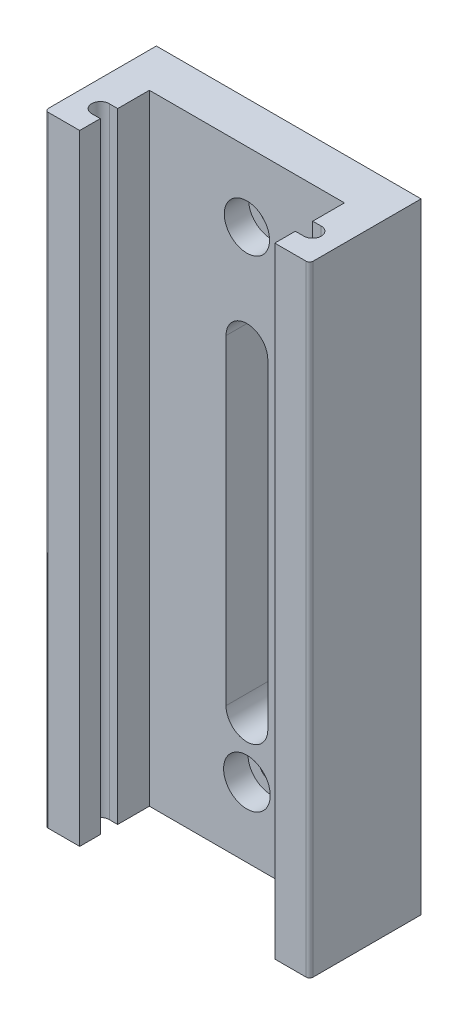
ISO-10303-21;
HEADER;
FILE_DESCRIPTION(('STEP AP214'),'2;1');
FILE_NAME('part.step','',(''),(''),'','','');
FILE_SCHEMA(('AUTOMOTIVE_DESIGN { 1 0 10303 214 1 1 1 1 }'));
ENDSEC;
DATA;
#1=APPLICATION_CONTEXT('core data for automotive mechanical design processes');
#2=APPLICATION_PROTOCOL_DEFINITION('international standard','automotive_design',2000,#1);
#3=PRODUCT_CONTEXT('',#1,'mechanical');
#4=PRODUCT('Part','Part','',(#3));
#5=PRODUCT_RELATED_PRODUCT_CATEGORY('part','',(#4));
#6=PRODUCT_DEFINITION_FORMATION('','',#4);
#7=PRODUCT_DEFINITION_CONTEXT('part definition',#1,'design');
#8=PRODUCT_DEFINITION('design','',#6,#7);
#9=PRODUCT_DEFINITION_SHAPE('','',#8);
#10=(LENGTH_UNIT() NAMED_UNIT(*) SI_UNIT(.MILLI.,.METRE.));
#11=(NAMED_UNIT(*) PLANE_ANGLE_UNIT() SI_UNIT($,.RADIAN.));
#12=(NAMED_UNIT(*) SI_UNIT($,.STERADIAN.) SOLID_ANGLE_UNIT());
#13=UNCERTAINTY_MEASURE_WITH_UNIT(LENGTH_MEASURE(1.E-05),#10,'distance_accuracy_value','');
#14=(GEOMETRIC_REPRESENTATION_CONTEXT(3) GLOBAL_UNCERTAINTY_ASSIGNED_CONTEXT((#13)) GLOBAL_UNIT_ASSIGNED_CONTEXT((#10,
#11,#12)) REPRESENTATION_CONTEXT('',''));
#15=CARTESIAN_POINT('',(0.,0.,0.));
#16=DIRECTION('',(0.,0.,1.));
#17=DIRECTION('',(1.,0.,0.));
#18=AXIS2_PLACEMENT_3D('',#15,#16,#17);
#19=CARTESIAN_POINT('',(5.,89.,0.));
#20=DIRECTION('',(0.,0.,-1.));
#21=DIRECTION('',(-1.,0.,0.));
#22=AXIS2_PLACEMENT_3D('',#19,#20,#21);
#23=PLANE('',#22);
#24=DIRECTION('',(1.,0.,0.));
#25=VECTOR('',#24,1.);
#26=CARTESIAN_POINT('',(5.,89.,0.));
#27=LINE('',#26,#25);
#28=CARTESIAN_POINT('',(0.5,89.,0.));
#29=VERTEX_POINT('',#28);
#30=CARTESIAN_POINT('',(5.,89.,0.));
#31=VERTEX_POINT('',#30);
#32=EDGE_CURVE('E275',#29,#31,#27,.T.);
#33=ORIENTED_EDGE('',*,*,#32,.F.);
#34=DIRECTION('',(0.,-1.,0.));
#35=VECTOR('',#34,1.);
#36=CARTESIAN_POINT('',(0.5,89.,0.));
#37=LINE('',#36,#35);
#38=CARTESIAN_POINT('',(0.5,0.,0.));
#39=VERTEX_POINT('',#38);
#40=EDGE_CURVE('E350',#29,#39,#37,.T.);
#41=ORIENTED_EDGE('',*,*,#40,.T.);
#42=DIRECTION('',(1.,0.,0.));
#43=VECTOR('',#42,1.);
#44=CARTESIAN_POINT('',(5.,0.,0.));
#45=LINE('',#44,#43);
#46=CARTESIAN_POINT('',(5.,0.,0.));
#47=VERTEX_POINT('',#46);
#48=EDGE_CURVE('E242',#39,#47,#45,.T.);
#49=ORIENTED_EDGE('',*,*,#48,.T.);
#50=DIRECTION('',(0.,-1.,0.));
#51=VECTOR('',#50,1.);
#52=CARTESIAN_POINT('',(5.,89.,0.));
#53=LINE('',#52,#51);
#54=EDGE_CURVE('E347',#31,#47,#53,.T.);
#55=ORIENTED_EDGE('',*,*,#54,.F.);
#56=EDGE_LOOP('',(#33,#41,#49,#55));
#57=FACE_BOUND('',#56,.T.);
#58=ADVANCED_FACE('F27',(#57),#23,.F.);
#59=CARTESIAN_POINT('',(5.,89.,-2.95030069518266));
#60=DIRECTION('',(-1.,0.,0.));
#61=DIRECTION('',(0.,0.,1.));
#62=AXIS2_PLACEMENT_3D('',#59,#60,#61);
#63=PLANE('',#62);
#64=DIRECTION('',(0.,0.,-1.));
#65=VECTOR('',#64,1.);
#66=CARTESIAN_POINT('',(5.,0.,-2.95030069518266));
#67=LINE('',#66,#65);
#68=CARTESIAN_POINT('',(5.,0.,-2.95030069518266));
#69=VERTEX_POINT('',#68);
#70=EDGE_CURVE('E244',#47,#69,#67,.T.);
#71=ORIENTED_EDGE('',*,*,#70,.T.);
#72=DIRECTION('',(0.,-1.,0.));
#73=VECTOR('',#72,1.);
#74=CARTESIAN_POINT('',(5.,89.,-2.95030069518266));
#75=LINE('',#74,#73);
#76=CARTESIAN_POINT('',(5.,89.,-2.95030069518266));
#77=VERTEX_POINT('',#76);
#78=EDGE_CURVE('E344',#77,#69,#75,.T.);
#79=ORIENTED_EDGE('',*,*,#78,.F.);
#80=DIRECTION('',(0.,0.,-1.));
#81=VECTOR('',#80,1.);
#82=CARTESIAN_POINT('',(5.,89.,-2.95030069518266));
#83=LINE('',#82,#81);
#84=EDGE_CURVE('E277',#31,#77,#83,.T.);
#85=ORIENTED_EDGE('',*,*,#84,.F.);
#86=ORIENTED_EDGE('',*,*,#54,.T.);
#87=EDGE_LOOP('',(#71,#79,#85,#86));
#88=FACE_BOUND('',#87,.T.);
#89=ADVANCED_FACE('F396',(#88),#63,.F.);
#90=CARTESIAN_POINT('',(3.79999999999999,89.,-2.95030069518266));
#91=DIRECTION('',(0.,0.,1.));
#92=DIRECTION('',(1.,0.,0.));
#93=AXIS2_PLACEMENT_3D('',#90,#91,#92);
#94=PLANE('',#93);
#95=DIRECTION('',(-1.,0.,0.));
#96=VECTOR('',#95,1.);
#97=CARTESIAN_POINT('',(3.79999999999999,0.,-2.95030069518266));
#98=LINE('',#97,#96);
#99=CARTESIAN_POINT('',(3.79999999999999,0.,-2.95030069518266));
#100=VERTEX_POINT('',#99);
#101=EDGE_CURVE('E246',#69,#100,#98,.T.);
#102=ORIENTED_EDGE('',*,*,#101,.T.);
#103=DIRECTION('',(0.,-1.,0.));
#104=VECTOR('',#103,1.);
#105=CARTESIAN_POINT('',(3.79999999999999,89.,-2.95030069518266));
#106=LINE('',#105,#104);
#107=CARTESIAN_POINT('',(3.79999999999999,89.,-2.95030069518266));
#108=VERTEX_POINT('',#107);
#109=EDGE_CURVE('E341',#108,#100,#106,.T.);
#110=ORIENTED_EDGE('',*,*,#109,.F.);
#111=DIRECTION('',(-1.,0.,0.));
#112=VECTOR('',#111,1.);
#113=CARTESIAN_POINT('',(3.79999999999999,89.,-2.95030069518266));
#114=LINE('',#113,#112);
#115=EDGE_CURVE('E279',#77,#108,#114,.T.);
#116=ORIENTED_EDGE('',*,*,#115,.F.);
#117=ORIENTED_EDGE('',*,*,#78,.T.);
#118=EDGE_LOOP('',(#102,#110,#116,#117));
#119=FACE_BOUND('',#118,.T.);
#120=ADVANCED_FACE('F402',(#119),#94,.F.);
#121=CARTESIAN_POINT('',(3.77258380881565,89.,-4.2));
#122=DIRECTION('',(0.,-1.,0.));
#123=DIRECTION('',(0.,0.,-1.));
#124=AXIS2_PLACEMENT_3D('',#121,#122,#123);
#125=CYLINDRICAL_SURFACE('',#124,1.25);
#126=CARTESIAN_POINT('',(3.77258380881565,0.,-4.2));
#127=DIRECTION('',(0.,-1.,0.));
#128=DIRECTION('',(0.,0.,1.));
#129=AXIS2_PLACEMENT_3D('',#126,#127,#128);
#130=CIRCLE('',#129,1.25);
#131=CARTESIAN_POINT('',(3.79999999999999,0.,-5.44969930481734));
#132=VERTEX_POINT('',#131);
#133=EDGE_CURVE('E248',#100,#132,#130,.T.);
#134=ORIENTED_EDGE('',*,*,#133,.T.);
#135=DIRECTION('',(0.,-1.,0.));
#136=VECTOR('',#135,1.);
#137=CARTESIAN_POINT('',(3.79999999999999,89.,-5.44969930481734));
#138=LINE('',#137,#136);
#139=CARTESIAN_POINT('',(3.79999999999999,89.,-5.44969930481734));
#140=VERTEX_POINT('',#139);
#141=EDGE_CURVE('E338',#140,#132,#138,.T.);
#142=ORIENTED_EDGE('',*,*,#141,.F.);
#143=CARTESIAN_POINT('',(3.77258380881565,89.,-4.2));
#144=DIRECTION('',(0.,-1.,0.));
#145=DIRECTION('',(0.,0.,1.));
#146=AXIS2_PLACEMENT_3D('',#143,#144,#145);
#147=CIRCLE('',#146,1.25);
#148=EDGE_CURVE('E281',#108,#140,#147,.T.);
#149=ORIENTED_EDGE('',*,*,#148,.F.);
#150=ORIENTED_EDGE('',*,*,#109,.T.);
#151=EDGE_LOOP('',(#134,#142,#149,#150));
#152=FACE_BOUND('',#151,.T.);
#153=ADVANCED_FACE('F404',(#152),#125,.F.);
#154=CARTESIAN_POINT('',(3.79999999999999,89.,-5.44969930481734));
#155=DIRECTION('',(0.,0.,-1.));
#156=DIRECTION('',(-1.,0.,0.));
#157=AXIS2_PLACEMENT_3D('',#154,#155,#156);
#158=PLANE('',#157);
#159=DIRECTION('',(1.,0.,0.));
#160=VECTOR('',#159,1.);
#161=CARTESIAN_POINT('',(3.79999999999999,0.,-5.44969930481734));
#162=LINE('',#161,#160);
#163=CARTESIAN_POINT('',(5.00000000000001,0.,-5.44969930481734));
#164=VERTEX_POINT('',#163);
#165=EDGE_CURVE('E250',#132,#164,#162,.T.);
#166=ORIENTED_EDGE('',*,*,#165,.T.);
#167=DIRECTION('',(0.,-1.,0.));
#168=VECTOR('',#167,1.);
#169=CARTESIAN_POINT('',(5.00000000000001,89.,-5.44969930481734));
#170=LINE('',#169,#168);
#171=CARTESIAN_POINT('',(5.00000000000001,89.,-5.44969930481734));
#172=VERTEX_POINT('',#171);
#173=EDGE_CURVE('E335',#172,#164,#170,.T.);
#174=ORIENTED_EDGE('',*,*,#173,.F.);
#175=DIRECTION('',(1.,0.,0.));
#176=VECTOR('',#175,1.);
#177=CARTESIAN_POINT('',(3.79999999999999,89.,-5.44969930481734));
#178=LINE('',#177,#176);
#179=EDGE_CURVE('E283',#140,#172,#178,.T.);
#180=ORIENTED_EDGE('',*,*,#179,.F.);
#181=ORIENTED_EDGE('',*,*,#141,.T.);
#182=EDGE_LOOP('',(#166,#174,#180,#181));
#183=FACE_BOUND('',#182,.T.);
#184=ADVANCED_FACE('F409',(#183),#158,.F.);
#185=CARTESIAN_POINT('',(5.,89.,-10.));
#186=DIRECTION('',(-1.,0.,0.));
#187=DIRECTION('',(0.,0.,1.));
#188=AXIS2_PLACEMENT_3D('',#185,#186,#187);
#189=PLANE('',#188);
#190=DIRECTION('',(0.,0.,-1.));
#191=VECTOR('',#190,1.);
#192=CARTESIAN_POINT('',(5.,0.,-10.));
#193=LINE('',#192,#191);
#194=CARTESIAN_POINT('',(5.,0.,-10.));
#195=VERTEX_POINT('',#194);
#196=EDGE_CURVE('E252',#164,#195,#193,.T.);
#197=ORIENTED_EDGE('',*,*,#196,.T.);
#198=DIRECTION('',(0.,-1.,0.));
#199=VECTOR('',#198,1.);
#200=CARTESIAN_POINT('',(5.,89.,-10.));
#201=LINE('',#200,#199);
#202=CARTESIAN_POINT('',(5.,89.,-10.));
#203=VERTEX_POINT('',#202);
#204=EDGE_CURVE('E332',#203,#195,#201,.T.);
#205=ORIENTED_EDGE('',*,*,#204,.F.);
#206=DIRECTION('',(0.,0.,-1.));
#207=VECTOR('',#206,1.);
#208=CARTESIAN_POINT('',(5.,89.,-10.));
#209=LINE('',#208,#207);
#210=EDGE_CURVE('E285',#172,#203,#209,.T.);
#211=ORIENTED_EDGE('',*,*,#210,.F.);
#212=ORIENTED_EDGE('',*,*,#173,.T.);
#213=EDGE_LOOP('',(#197,#205,#211,#212));
#214=FACE_BOUND('',#213,.T.);
#215=ADVANCED_FACE('F415',(#214),#189,.F.);
#216=CARTESIAN_POINT('',(5.,89.,-10.));
#217=DIRECTION('',(0.,0.,-1.));
#218=DIRECTION('',(-1.,0.,0.));
#219=AXIS2_PLACEMENT_3D('',#216,#217,#218);
#220=PLANE('',#219);
#221=DIRECTION('',(0.,1.,0.));
#222=VECTOR('',#221,1.);
#223=CARTESIAN_POINT('',(22.,64.,-10.));
#224=LINE('',#223,#222);
#225=CARTESIAN_POINT('',(22.,18.,-10.));
#226=VERTEX_POINT('',#225);
#227=CARTESIAN_POINT('',(22.,64.,-10.));
#228=VERTEX_POINT('',#227);
#229=EDGE_CURVE('E191',#226,#228,#224,.T.);
#230=ORIENTED_EDGE('',*,*,#229,.F.);
#231=CARTESIAN_POINT('',(19.,18.,-10.));
#232=DIRECTION('',(0.,0.,1.));
#233=DIRECTION('',(1.,0.,0.));
#234=AXIS2_PLACEMENT_3D('',#231,#232,#233);
#235=CIRCLE('',#234,3.);
#236=CARTESIAN_POINT('',(16.,18.,-10.));
#237=VERTEX_POINT('',#236);
#238=EDGE_CURVE('E195',#237,#226,#235,.T.);
#239=ORIENTED_EDGE('',*,*,#238,.F.);
#240=DIRECTION('',(0.,-1.,0.));
#241=VECTOR('',#240,1.);
#242=CARTESIAN_POINT('',(16.,64.,-10.));
#243=LINE('',#242,#241);
#244=CARTESIAN_POINT('',(16.,64.,-10.));
#245=VERTEX_POINT('',#244);
#246=EDGE_CURVE('E200',#245,#237,#243,.T.);
#247=ORIENTED_EDGE('',*,*,#246,.F.);
#248=CARTESIAN_POINT('',(19.,64.,-10.));
#249=DIRECTION('',(0.,0.,1.));
#250=DIRECTION('',(1.,0.,0.));
#251=AXIS2_PLACEMENT_3D('',#248,#249,#250);
#252=CIRCLE('',#251,3.);
#253=EDGE_CURVE('E179',#228,#245,#252,.T.);
#254=ORIENTED_EDGE('',*,*,#253,.F.);
#255=EDGE_LOOP('',(#230,#239,#247,#254));
#256=FACE_BOUND('',#255,.T.);
#257=CARTESIAN_POINT('',(19.,10.,-10.));
#258=DIRECTION('',(0.,0.,1.));
#259=DIRECTION('',(1.,0.,0.));
#260=AXIS2_PLACEMENT_3D('',#257,#258,#259);
#261=CIRCLE('',#260,3.35);
#262=CARTESIAN_POINT('',(22.35,10.,-10.));
#263=VERTEX_POINT('',#262);
#264=EDGE_CURVE('E230',#263,#263,#261,.T.);
#265=ORIENTED_EDGE('',*,*,#264,.F.);
#266=EDGE_LOOP('',(#265));
#267=FACE_BOUND('',#266,.T.);
#268=CARTESIAN_POINT('',(19.,79.,-10.));
#269=DIRECTION('',(0.,0.,1.));
#270=DIRECTION('',(1.,0.,0.));
#271=AXIS2_PLACEMENT_3D('',#268,#269,#270);
#272=CIRCLE('',#271,3.25);
#273=CARTESIAN_POINT('',(22.25,79.,-10.));
#274=VERTEX_POINT('',#273);
#275=EDGE_CURVE('E236',#274,#274,#272,.T.);
#276=ORIENTED_EDGE('',*,*,#275,.F.);
#277=EDGE_LOOP('',(#276));
#278=FACE_BOUND('',#277,.T.);
#279=DIRECTION('',(1.,0.,0.));
#280=VECTOR('',#279,1.);
#281=CARTESIAN_POINT('',(5.,0.,-10.));
#282=LINE('',#281,#280);
#283=CARTESIAN_POINT('',(33.,0.,-10.));
#284=VERTEX_POINT('',#283);
#285=EDGE_CURVE('E254',#195,#284,#282,.T.);
#286=ORIENTED_EDGE('',*,*,#285,.T.);
#287=DIRECTION('',(0.,-1.,0.));
#288=VECTOR('',#287,1.);
#289=CARTESIAN_POINT('',(33.,89.,-10.));
#290=LINE('',#289,#288);
#291=CARTESIAN_POINT('',(33.,89.,-10.));
#292=VERTEX_POINT('',#291);
#293=EDGE_CURVE('E329',#292,#284,#290,.T.);
#294=ORIENTED_EDGE('',*,*,#293,.F.);
#295=DIRECTION('',(1.,0.,0.));
#296=VECTOR('',#295,1.);
#297=CARTESIAN_POINT('',(5.,89.,-10.));
#298=LINE('',#297,#296);
#299=EDGE_CURVE('E287',#203,#292,#298,.T.);
#300=ORIENTED_EDGE('',*,*,#299,.F.);
#301=ORIENTED_EDGE('',*,*,#204,.T.);
#302=EDGE_LOOP('',(#286,#294,#300,#301));
#303=FACE_BOUND('',#302,.T.);
#304=ADVANCED_FACE('F197',(#256,#267,#278,#303),#220,.F.);
#305=CARTESIAN_POINT('',(33.,89.,-10.));
#306=DIRECTION('',(1.,0.,0.));
#307=DIRECTION('',(0.,0.,-1.));
#308=AXIS2_PLACEMENT_3D('',#305,#306,#307);
#309=PLANE('',#308);
#310=DIRECTION('',(0.,0.,1.));
#311=VECTOR('',#310,1.);
#312=CARTESIAN_POINT('',(33.,0.,-10.));
#313=LINE('',#312,#311);
#314=CARTESIAN_POINT('',(33.,0.,-5.44969930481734));
#315=VERTEX_POINT('',#314);
#316=EDGE_CURVE('E256',#284,#315,#313,.T.);
#317=ORIENTED_EDGE('',*,*,#316,.T.);
#318=DIRECTION('',(0.,-1.,0.));
#319=VECTOR('',#318,1.);
#320=CARTESIAN_POINT('',(33.,89.,-5.44969930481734));
#321=LINE('',#320,#319);
#322=CARTESIAN_POINT('',(33.,89.,-5.44969930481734));
#323=VERTEX_POINT('',#322);
#324=EDGE_CURVE('E326',#323,#315,#321,.T.);
#325=ORIENTED_EDGE('',*,*,#324,.F.);
#326=DIRECTION('',(0.,0.,1.));
#327=VECTOR('',#326,1.);
#328=CARTESIAN_POINT('',(33.,89.,-10.));
#329=LINE('',#328,#327);
#330=EDGE_CURVE('E289',#292,#323,#329,.T.);
#331=ORIENTED_EDGE('',*,*,#330,.F.);
#332=ORIENTED_EDGE('',*,*,#293,.T.);
#333=EDGE_LOOP('',(#317,#325,#331,#332));
#334=FACE_BOUND('',#333,.T.);
#335=ADVANCED_FACE('F423',(#334),#309,.F.);
#336=CARTESIAN_POINT('',(34.2,89.,-5.44969930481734));
#337=DIRECTION('',(0.,0.,-1.));
#338=DIRECTION('',(-1.,0.,0.));
#339=AXIS2_PLACEMENT_3D('',#336,#337,#338);
#340=PLANE('',#339);
#341=DIRECTION('',(1.,0.,0.));
#342=VECTOR('',#341,1.);
#343=CARTESIAN_POINT('',(34.2,0.,-5.44969930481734));
#344=LINE('',#343,#342);
#345=CARTESIAN_POINT('',(34.2,0.,-5.44969930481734));
#346=VERTEX_POINT('',#345);
#347=EDGE_CURVE('E258',#315,#346,#344,.T.);
#348=ORIENTED_EDGE('',*,*,#347,.T.);
#349=DIRECTION('',(0.,-1.,0.));
#350=VECTOR('',#349,1.);
#351=CARTESIAN_POINT('',(34.2,89.,-5.44969930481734));
#352=LINE('',#351,#350);
#353=CARTESIAN_POINT('',(34.2,89.,-5.44969930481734));
#354=VERTEX_POINT('',#353);
#355=EDGE_CURVE('E323',#354,#346,#352,.T.);
#356=ORIENTED_EDGE('',*,*,#355,.F.);
#357=DIRECTION('',(1.,0.,0.));
#358=VECTOR('',#357,1.);
#359=CARTESIAN_POINT('',(34.2,89.,-5.44969930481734));
#360=LINE('',#359,#358);
#361=EDGE_CURVE('E291',#323,#354,#360,.T.);
#362=ORIENTED_EDGE('',*,*,#361,.F.);
#363=ORIENTED_EDGE('',*,*,#324,.T.);
#364=EDGE_LOOP('',(#348,#356,#362,#363));
#365=FACE_BOUND('',#364,.T.);
#366=ADVANCED_FACE('F429',(#365),#340,.F.);
#367=CARTESIAN_POINT('',(34.2274161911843,89.,-4.2));
#368=DIRECTION('',(0.,-1.,0.));
#369=DIRECTION('',(0.,0.,-1.));
#370=AXIS2_PLACEMENT_3D('',#367,#368,#369);
#371=CYLINDRICAL_SURFACE('',#370,1.25);
#372=CARTESIAN_POINT('',(34.2274161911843,0.,-4.2));
#373=DIRECTION('',(0.,-1.,0.));
#374=DIRECTION('',(0.,0.,-1.));
#375=AXIS2_PLACEMENT_3D('',#372,#373,#374);
#376=CIRCLE('',#375,1.25);
#377=CARTESIAN_POINT('',(34.2,0.,-2.95030069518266));
#378=VERTEX_POINT('',#377);
#379=EDGE_CURVE('E260',#346,#378,#376,.T.);
#380=ORIENTED_EDGE('',*,*,#379,.T.);
#381=DIRECTION('',(0.,-1.,0.));
#382=VECTOR('',#381,1.);
#383=CARTESIAN_POINT('',(34.2,89.,-2.95030069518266));
#384=LINE('',#383,#382);
#385=CARTESIAN_POINT('',(34.2,89.,-2.95030069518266));
#386=VERTEX_POINT('',#385);
#387=EDGE_CURVE('E320',#386,#378,#384,.T.);
#388=ORIENTED_EDGE('',*,*,#387,.F.);
#389=CARTESIAN_POINT('',(34.2274161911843,89.,-4.2));
#390=DIRECTION('',(0.,-1.,0.));
#391=DIRECTION('',(0.,0.,-1.));
#392=AXIS2_PLACEMENT_3D('',#389,#390,#391);
#393=CIRCLE('',#392,1.25);
#394=EDGE_CURVE('E293',#354,#386,#393,.T.);
#395=ORIENTED_EDGE('',*,*,#394,.F.);
#396=ORIENTED_EDGE('',*,*,#355,.T.);
#397=EDGE_LOOP('',(#380,#388,#395,#396));
#398=FACE_BOUND('',#397,.T.);
#399=ADVANCED_FACE('F433',(#398),#371,.F.);
#400=CARTESIAN_POINT('',(34.2,89.,-2.95030069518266));
#401=DIRECTION('',(0.,0.,1.));
#402=DIRECTION('',(1.,0.,0.));
#403=AXIS2_PLACEMENT_3D('',#400,#401,#402);
#404=PLANE('',#403);
#405=DIRECTION('',(-1.,0.,0.));
#406=VECTOR('',#405,1.);
#407=CARTESIAN_POINT('',(34.2,0.,-2.95030069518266));
#408=LINE('',#407,#406);
#409=CARTESIAN_POINT('',(33.,0.,-2.95030069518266));
#410=VERTEX_POINT('',#409);
#411=EDGE_CURVE('E262',#378,#410,#408,.T.);
#412=ORIENTED_EDGE('',*,*,#411,.T.);
#413=DIRECTION('',(0.,-1.,0.));
#414=VECTOR('',#413,1.);
#415=CARTESIAN_POINT('',(33.,89.,-2.95030069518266));
#416=LINE('',#415,#414);
#417=CARTESIAN_POINT('',(33.,89.,-2.95030069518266));
#418=VERTEX_POINT('',#417);
#419=EDGE_CURVE('E317',#418,#410,#416,.T.);
#420=ORIENTED_EDGE('',*,*,#419,.F.);
#421=DIRECTION('',(-1.,0.,0.));
#422=VECTOR('',#421,1.);
#423=CARTESIAN_POINT('',(34.2,89.,-2.95030069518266));
#424=LINE('',#423,#422);
#425=EDGE_CURVE('E295',#386,#418,#424,.T.);
#426=ORIENTED_EDGE('',*,*,#425,.F.);
#427=ORIENTED_EDGE('',*,*,#387,.T.);
#428=EDGE_LOOP('',(#412,#420,#426,#427));
#429=FACE_BOUND('',#428,.T.);
#430=ADVANCED_FACE('F438',(#429),#404,.F.);
#431=CARTESIAN_POINT('',(33.,89.,-2.95030069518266));
#432=DIRECTION('',(1.,0.,0.));
#433=DIRECTION('',(0.,0.,-1.));
#434=AXIS2_PLACEMENT_3D('',#431,#432,#433);
#435=PLANE('',#434);
#436=DIRECTION('',(0.,0.,1.));
#437=VECTOR('',#436,1.);
#438=CARTESIAN_POINT('',(33.,0.,-2.95030069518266));
#439=LINE('',#438,#437);
#440=CARTESIAN_POINT('',(33.,0.,0.));
#441=VERTEX_POINT('',#440);
#442=EDGE_CURVE('E264',#410,#441,#439,.T.);
#443=ORIENTED_EDGE('',*,*,#442,.T.);
#444=DIRECTION('',(0.,-1.,0.));
#445=VECTOR('',#444,1.);
#446=CARTESIAN_POINT('',(33.,89.,0.));
#447=LINE('',#446,#445);
#448=CARTESIAN_POINT('',(33.,89.,0.));
#449=VERTEX_POINT('',#448);
#450=EDGE_CURVE('E314',#449,#441,#447,.T.);
#451=ORIENTED_EDGE('',*,*,#450,.F.);
#452=DIRECTION('',(0.,0.,1.));
#453=VECTOR('',#452,1.);
#454=CARTESIAN_POINT('',(33.,89.,-2.95030069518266));
#455=LINE('',#454,#453);
#456=EDGE_CURVE('E297',#418,#449,#455,.T.);
#457=ORIENTED_EDGE('',*,*,#456,.F.);
#458=ORIENTED_EDGE('',*,*,#419,.T.);
#459=EDGE_LOOP('',(#443,#451,#457,#458));
#460=FACE_BOUND('',#459,.T.);
#461=ADVANCED_FACE('F442',(#460),#435,.F.);
#462=CARTESIAN_POINT('',(33.,89.,0.));
#463=DIRECTION('',(0.,0.,-1.));
#464=DIRECTION('',(-1.,0.,0.));
#465=AXIS2_PLACEMENT_3D('',#462,#463,#464);
#466=PLANE('',#465);
#467=DIRECTION('',(1.,0.,0.));
#468=VECTOR('',#467,1.);
#469=CARTESIAN_POINT('',(33.,0.,0.));
#470=LINE('',#469,#468);
#471=CARTESIAN_POINT('',(37.5,0.,0.));
#472=VERTEX_POINT('',#471);
#473=EDGE_CURVE('E266',#441,#472,#470,.T.);
#474=ORIENTED_EDGE('',*,*,#473,.T.);
#475=DIRECTION('',(0.,-1.,0.));
#476=VECTOR('',#475,1.);
#477=CARTESIAN_POINT('',(37.5,89.,0.));
#478=LINE('',#477,#476);
#479=CARTESIAN_POINT('',(37.5,89.,0.));
#480=VERTEX_POINT('',#479);
#481=EDGE_CURVE('E11',#472,#480,#478,.F.);
#482=ORIENTED_EDGE('',*,*,#481,.T.);
#483=DIRECTION('',(1.,0.,0.));
#484=VECTOR('',#483,1.);
#485=CARTESIAN_POINT('',(33.,89.,0.));
#486=LINE('',#485,#484);
#487=EDGE_CURVE('E299',#449,#480,#486,.T.);
#488=ORIENTED_EDGE('',*,*,#487,.F.);
#489=ORIENTED_EDGE('',*,*,#450,.T.);
#490=EDGE_LOOP('',(#474,#482,#488,#489));
#491=FACE_BOUND('',#490,.T.);
#492=ADVANCED_FACE('F444',(#491),#466,.F.);
#493=CARTESIAN_POINT('',(38.,89.,0.));
#494=DIRECTION('',(-1.,0.,0.));
#495=DIRECTION('',(0.,0.,1.));
#496=AXIS2_PLACEMENT_3D('',#493,#494,#495);
#497=PLANE('',#496);
#498=DIRECTION('',(0.,0.,-1.));
#499=VECTOR('',#498,1.);
#500=CARTESIAN_POINT('',(38.,89.,0.));
#501=LINE('',#500,#499);
#502=CARTESIAN_POINT('',(38.,89.,-0.5));
#503=VERTEX_POINT('',#502);
#504=CARTESIAN_POINT('',(38.,89.,-16.));
#505=VERTEX_POINT('',#504);
#506=EDGE_CURVE('E301',#503,#505,#501,.T.);
#507=ORIENTED_EDGE('',*,*,#506,.F.);
#508=DIRECTION('',(0.,-1.,0.));
#509=VECTOR('',#508,1.);
#510=CARTESIAN_POINT('',(38.,89.,-0.5));
#511=LINE('',#510,#509);
#512=CARTESIAN_POINT('',(38.,0.,-0.5));
#513=VERTEX_POINT('',#512);
#514=EDGE_CURVE('E34',#503,#513,#511,.T.);
#515=ORIENTED_EDGE('',*,*,#514,.T.);
#516=DIRECTION('',(0.,0.,-1.));
#517=VECTOR('',#516,1.);
#518=CARTESIAN_POINT('',(38.,0.,0.));
#519=LINE('',#518,#517);
#520=CARTESIAN_POINT('',(38.,0.,-16.));
#521=VERTEX_POINT('',#520);
#522=EDGE_CURVE('E268',#513,#521,#519,.T.);
#523=ORIENTED_EDGE('',*,*,#522,.T.);
#524=DIRECTION('',(0.,-1.,0.));
#525=VECTOR('',#524,1.);
#526=CARTESIAN_POINT('',(38.,89.,-16.));
#527=LINE('',#526,#525);
#528=EDGE_CURVE('E311',#505,#521,#527,.T.);
#529=ORIENTED_EDGE('',*,*,#528,.F.);
#530=EDGE_LOOP('',(#507,#515,#523,#529));
#531=FACE_BOUND('',#530,.T.);
#532=ADVANCED_FACE('F365',(#531),#497,.F.);
#533=CARTESIAN_POINT('',(0.,89.,-16.));
#534=DIRECTION('',(0.,0.,1.));
#535=DIRECTION('',(1.,0.,0.));
#536=AXIS2_PLACEMENT_3D('',#533,#534,#535);
#537=PLANE('',#536);
#538=DIRECTION('',(0.,-1.,0.));
#539=VECTOR('',#538,1.);
#540=CARTESIAN_POINT('',(16.,64.,-16.));
#541=LINE('',#540,#539);
#542=CARTESIAN_POINT('',(16.,64.,-16.));
#543=VERTEX_POINT('',#542);
#544=CARTESIAN_POINT('',(16.,18.,-16.));
#545=VERTEX_POINT('',#544);
#546=EDGE_CURVE('E211',#543,#545,#541,.T.);
#547=ORIENTED_EDGE('',*,*,#546,.T.);
#548=CARTESIAN_POINT('',(19.,18.,-16.));
#549=DIRECTION('',(0.,0.,1.));
#550=DIRECTION('',(1.,0.,0.));
#551=AXIS2_PLACEMENT_3D('',#548,#549,#550);
#552=CIRCLE('',#551,3.);
#553=CARTESIAN_POINT('',(22.,18.,-16.));
#554=VERTEX_POINT('',#553);
#555=EDGE_CURVE('E202',#545,#554,#552,.T.);
#556=ORIENTED_EDGE('',*,*,#555,.T.);
#557=DIRECTION('',(0.,1.,0.));
#558=VECTOR('',#557,1.);
#559=CARTESIAN_POINT('',(22.,64.,-16.));
#560=LINE('',#559,#558);
#561=CARTESIAN_POINT('',(22.,64.,-16.));
#562=VERTEX_POINT('',#561);
#563=EDGE_CURVE('E208',#554,#562,#560,.T.);
#564=ORIENTED_EDGE('',*,*,#563,.T.);
#565=CARTESIAN_POINT('',(19.,64.,-16.));
#566=DIRECTION('',(0.,0.,1.));
#567=DIRECTION('',(1.,0.,0.));
#568=AXIS2_PLACEMENT_3D('',#565,#566,#567);
#569=CIRCLE('',#568,3.);
#570=EDGE_CURVE('E182',#562,#543,#569,.T.);
#571=ORIENTED_EDGE('',*,*,#570,.T.);
#572=EDGE_LOOP('',(#547,#556,#564,#571));
#573=FACE_BOUND('',#572,.T.);
#574=CARTESIAN_POINT('',(19.,10.,-16.));
#575=DIRECTION('',(0.,0.,1.));
#576=DIRECTION('',(1.,0.,0.));
#577=AXIS2_PLACEMENT_3D('',#574,#575,#576);
#578=CIRCLE('',#577,1.75);
#579=CARTESIAN_POINT('',(20.75,10.,-16.));
#580=VERTEX_POINT('',#579);
#581=EDGE_CURVE('E221',#580,#580,#578,.T.);
#582=ORIENTED_EDGE('',*,*,#581,.T.);
#583=EDGE_LOOP('',(#582));
#584=FACE_BOUND('',#583,.T.);
#585=CARTESIAN_POINT('',(19.,79.,-16.));
#586=DIRECTION('',(0.,0.,1.));
#587=DIRECTION('',(1.,0.,0.));
#588=AXIS2_PLACEMENT_3D('',#585,#586,#587);
#589=CIRCLE('',#588,1.75);
#590=CARTESIAN_POINT('',(20.75,79.,-16.));
#591=VERTEX_POINT('',#590);
#592=EDGE_CURVE('E227',#591,#591,#589,.T.);
#593=ORIENTED_EDGE('',*,*,#592,.T.);
#594=EDGE_LOOP('',(#593));
#595=FACE_BOUND('',#594,.T.);
#596=DIRECTION('',(-1.,0.,0.));
#597=VECTOR('',#596,1.);
#598=CARTESIAN_POINT('',(0.,0.,-16.));
#599=LINE('',#598,#597);
#600=CARTESIAN_POINT('',(0.,0.,-16.));
#601=VERTEX_POINT('',#600);
#602=EDGE_CURVE('E270',#521,#601,#599,.T.);
#603=ORIENTED_EDGE('',*,*,#602,.T.);
#604=DIRECTION('',(0.,-1.,0.));
#605=VECTOR('',#604,1.);
#606=CARTESIAN_POINT('',(0.,89.,-16.));
#607=LINE('',#606,#605);
#608=CARTESIAN_POINT('',(0.,89.,-16.));
#609=VERTEX_POINT('',#608);
#610=EDGE_CURVE('E308',#609,#601,#607,.T.);
#611=ORIENTED_EDGE('',*,*,#610,.F.);
#612=DIRECTION('',(-1.,0.,0.));
#613=VECTOR('',#612,1.);
#614=CARTESIAN_POINT('',(0.,89.,-16.));
#615=LINE('',#614,#613);
#616=EDGE_CURVE('E303',#505,#609,#615,.T.);
#617=ORIENTED_EDGE('',*,*,#616,.F.);
#618=ORIENTED_EDGE('',*,*,#528,.T.);
#619=EDGE_LOOP('',(#603,#611,#617,#618));
#620=FACE_BOUND('',#619,.T.);
#621=ADVANCED_FACE('F376',(#573,#584,#595,#620),#537,.F.);
#622=CARTESIAN_POINT('',(0.,89.,0.));
#623=DIRECTION('',(1.,0.,0.));
#624=DIRECTION('',(0.,0.,-1.));
#625=AXIS2_PLACEMENT_3D('',#622,#623,#624);
#626=PLANE('',#625);
#627=DIRECTION('',(0.,0.,1.));
#628=VECTOR('',#627,1.);
#629=CARTESIAN_POINT('',(0.,0.,0.));
#630=LINE('',#629,#628);
#631=CARTESIAN_POINT('',(0.,0.,-0.5));
#632=VERTEX_POINT('',#631);
#633=EDGE_CURVE('E272',#601,#632,#630,.T.);
#634=ORIENTED_EDGE('',*,*,#633,.T.);
#635=DIRECTION('',(0.,-1.,0.));
#636=VECTOR('',#635,1.);
#637=CARTESIAN_POINT('',(0.,89.,-0.5));
#638=LINE('',#637,#636);
#639=CARTESIAN_POINT('',(0.,89.,-0.5));
#640=VERTEX_POINT('',#639);
#641=EDGE_CURVE('E357',#632,#640,#638,.F.);
#642=ORIENTED_EDGE('',*,*,#641,.T.);
#643=DIRECTION('',(0.,0.,1.));
#644=VECTOR('',#643,1.);
#645=CARTESIAN_POINT('',(0.,89.,0.));
#646=LINE('',#645,#644);
#647=EDGE_CURVE('E305',#609,#640,#646,.T.);
#648=ORIENTED_EDGE('',*,*,#647,.F.);
#649=ORIENTED_EDGE('',*,*,#610,.T.);
#650=EDGE_LOOP('',(#634,#642,#648,#649));
#651=FACE_BOUND('',#650,.T.);
#652=ADVANCED_FACE('F380',(#651),#626,.F.);
#653=CARTESIAN_POINT('',(34.2274161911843,89.,-4.2));
#654=DIRECTION('',(0.,-1.,0.));
#655=DIRECTION('',(0.,0.,-1.));
#656=AXIS2_PLACEMENT_3D('',#653,#654,#655);
#657=PLANE('',#656);
#658=ORIENTED_EDGE('',*,*,#647,.T.);
#659=CARTESIAN_POINT('',(0.5,89.,-0.5));
#660=DIRECTION('',(0.,-1.,0.));
#661=DIRECTION('',(0.,0.,-1.));
#662=AXIS2_PLACEMENT_3D('',#659,#660,#661);
#663=CIRCLE('',#662,0.5);
#664=EDGE_CURVE('E360',#640,#29,#663,.F.);
#665=ORIENTED_EDGE('',*,*,#664,.T.);
#666=ORIENTED_EDGE('',*,*,#32,.T.);
#667=ORIENTED_EDGE('',*,*,#84,.T.);
#668=ORIENTED_EDGE('',*,*,#115,.T.);
#669=ORIENTED_EDGE('',*,*,#148,.T.);
#670=ORIENTED_EDGE('',*,*,#179,.T.);
#671=ORIENTED_EDGE('',*,*,#210,.T.);
#672=ORIENTED_EDGE('',*,*,#299,.T.);
#673=ORIENTED_EDGE('',*,*,#330,.T.);
#674=ORIENTED_EDGE('',*,*,#361,.T.);
#675=ORIENTED_EDGE('',*,*,#394,.T.);
#676=ORIENTED_EDGE('',*,*,#425,.T.);
#677=ORIENTED_EDGE('',*,*,#456,.T.);
#678=ORIENTED_EDGE('',*,*,#487,.T.);
#679=CARTESIAN_POINT('',(37.5,89.,-0.5));
#680=DIRECTION('',(0.,-1.,0.));
#681=DIRECTION('',(0.,0.,-1.));
#682=AXIS2_PLACEMENT_3D('',#679,#680,#681);
#683=CIRCLE('',#682,0.5);
#684=EDGE_CURVE('E41',#480,#503,#683,.F.);
#685=ORIENTED_EDGE('',*,*,#684,.T.);
#686=ORIENTED_EDGE('',*,*,#506,.T.);
#687=ORIENTED_EDGE('',*,*,#616,.T.);
#688=EDGE_LOOP('',(#658,#665,#666,#667,#668,#669,#670,#671,#672,#673,#674,#675,#676,#677,#678,
#685,#686,#687));
#689=FACE_BOUND('',#688,.T.);
#690=ADVANCED_FACE('F383',(#689),#657,.F.);
#691=CARTESIAN_POINT('',(34.2274161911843,0.,-4.2));
#692=DIRECTION('',(0.,-1.,0.));
#693=DIRECTION('',(0.,0.,-1.));
#694=AXIS2_PLACEMENT_3D('',#691,#692,#693);
#695=PLANE('',#694);
#696=ORIENTED_EDGE('',*,*,#48,.F.);
#697=CARTESIAN_POINT('',(0.5,0.,-0.5));
#698=DIRECTION('',(0.,-1.,0.));
#699=DIRECTION('',(0.,0.,-1.));
#700=AXIS2_PLACEMENT_3D('',#697,#698,#699);
#701=CIRCLE('',#700,0.5);
#702=EDGE_CURVE('E355',#39,#632,#701,.T.);
#703=ORIENTED_EDGE('',*,*,#702,.T.);
#704=ORIENTED_EDGE('',*,*,#633,.F.);
#705=ORIENTED_EDGE('',*,*,#602,.F.);
#706=ORIENTED_EDGE('',*,*,#522,.F.);
#707=CARTESIAN_POINT('',(37.5,0.,-0.5));
#708=DIRECTION('',(0.,-1.,0.));
#709=DIRECTION('',(0.,0.,-1.));
#710=AXIS2_PLACEMENT_3D('',#707,#708,#709);
#711=CIRCLE('',#710,0.5);
#712=EDGE_CURVE('E353',#513,#472,#711,.T.);
#713=ORIENTED_EDGE('',*,*,#712,.T.);
#714=ORIENTED_EDGE('',*,*,#473,.F.);
#715=ORIENTED_EDGE('',*,*,#442,.F.);
#716=ORIENTED_EDGE('',*,*,#411,.F.);
#717=ORIENTED_EDGE('',*,*,#379,.F.);
#718=ORIENTED_EDGE('',*,*,#347,.F.);
#719=ORIENTED_EDGE('',*,*,#316,.F.);
#720=ORIENTED_EDGE('',*,*,#285,.F.);
#721=ORIENTED_EDGE('',*,*,#196,.F.);
#722=ORIENTED_EDGE('',*,*,#165,.F.);
#723=ORIENTED_EDGE('',*,*,#133,.F.);
#724=ORIENTED_EDGE('',*,*,#101,.F.);
#725=ORIENTED_EDGE('',*,*,#70,.F.);
#726=EDGE_LOOP('',(#696,#703,#704,#705,#706,#713,#714,#715,#716,#717,#718,#719,#720,#721,#722,
#723,#724,#725));
#727=FACE_BOUND('',#726,.T.);
#728=ADVANCED_FACE('F371',(#727),#695,.T.);
#729=CARTESIAN_POINT('',(19.,79.,-13.5));
#730=DIRECTION('',(0.,0.,1.));
#731=DIRECTION('',(1.,0.,0.));
#732=AXIS2_PLACEMENT_3D('',#729,#730,#731);
#733=CYLINDRICAL_SURFACE('',#732,3.25);
#734=CARTESIAN_POINT('',(19.,79.,-13.5));
#735=DIRECTION('',(0.,0.,1.));
#736=DIRECTION('',(1.,0.,0.));
#737=AXIS2_PLACEMENT_3D('',#734,#735,#736);
#738=CIRCLE('',#737,3.25);
#739=CARTESIAN_POINT('',(22.25,79.,-13.5));
#740=VERTEX_POINT('',#739);
#741=EDGE_CURVE('E239',#740,#740,#738,.T.);
#742=ORIENTED_EDGE('',*,*,#741,.F.);
#743=EDGE_LOOP('',(#742));
#744=FACE_BOUND('',#743,.T.);
#745=ORIENTED_EDGE('',*,*,#275,.T.);
#746=EDGE_LOOP('',(#745));
#747=FACE_BOUND('',#746,.T.);
#748=ADVANCED_FACE('F489',(#744,#747),#733,.F.);
#749=CARTESIAN_POINT('',(19.,79.,-13.5));
#750=DIRECTION('',(0.,0.,1.));
#751=DIRECTION('',(1.,0.,0.));
#752=AXIS2_PLACEMENT_3D('',#749,#750,#751);
#753=PLANE('',#752);
#754=CARTESIAN_POINT('',(19.,79.,-13.5));
#755=DIRECTION('',(0.,0.,1.));
#756=DIRECTION('',(1.,0.,0.));
#757=AXIS2_PLACEMENT_3D('',#754,#755,#756);
#758=CIRCLE('',#757,1.75);
#759=CARTESIAN_POINT('',(20.75,79.,-13.5));
#760=VERTEX_POINT('',#759);
#761=EDGE_CURVE('E224',#760,#760,#758,.T.);
#762=ORIENTED_EDGE('',*,*,#761,.F.);
#763=EDGE_LOOP('',(#762));
#764=FACE_BOUND('',#763,.T.);
#765=ORIENTED_EDGE('',*,*,#741,.T.);
#766=EDGE_LOOP('',(#765));
#767=FACE_BOUND('',#766,.T.);
#768=ADVANCED_FACE('F493',(#764,#767),#753,.T.);
#769=CARTESIAN_POINT('',(19.,10.,-13.5));
#770=DIRECTION('',(0.,0.,1.));
#771=DIRECTION('',(1.,0.,0.));
#772=AXIS2_PLACEMENT_3D('',#769,#770,#771);
#773=CYLINDRICAL_SURFACE('',#772,3.35);
#774=CARTESIAN_POINT('',(19.,10.,-13.5));
#775=DIRECTION('',(0.,0.,1.));
#776=DIRECTION('',(1.,0.,0.));
#777=AXIS2_PLACEMENT_3D('',#774,#775,#776);
#778=CIRCLE('',#777,3.35);
#779=CARTESIAN_POINT('',(22.35,10.,-13.5));
#780=VERTEX_POINT('',#779);
#781=EDGE_CURVE('E233',#780,#780,#778,.T.);
#782=ORIENTED_EDGE('',*,*,#781,.F.);
#783=EDGE_LOOP('',(#782));
#784=FACE_BOUND('',#783,.T.);
#785=ORIENTED_EDGE('',*,*,#264,.T.);
#786=EDGE_LOOP('',(#785));
#787=FACE_BOUND('',#786,.T.);
#788=ADVANCED_FACE('F500',(#784,#787),#773,.F.);
#789=CARTESIAN_POINT('',(19.,10.,-13.5));
#790=DIRECTION('',(0.,0.,1.));
#791=DIRECTION('',(1.,0.,0.));
#792=AXIS2_PLACEMENT_3D('',#789,#790,#791);
#793=PLANE('',#792);
#794=CARTESIAN_POINT('',(19.,10.,-13.5));
#795=DIRECTION('',(0.,0.,1.));
#796=DIRECTION('',(1.,0.,0.));
#797=AXIS2_PLACEMENT_3D('',#794,#795,#796);
#798=CIRCLE('',#797,1.75);
#799=CARTESIAN_POINT('',(20.75,10.,-13.5));
#800=VERTEX_POINT('',#799);
#801=EDGE_CURVE('E216',#800,#800,#798,.T.);
#802=ORIENTED_EDGE('',*,*,#801,.F.);
#803=EDGE_LOOP('',(#802));
#804=FACE_BOUND('',#803,.T.);
#805=ORIENTED_EDGE('',*,*,#781,.T.);
#806=EDGE_LOOP('',(#805));
#807=FACE_BOUND('',#806,.T.);
#808=ADVANCED_FACE('F504',(#804,#807),#793,.T.);
#809=CARTESIAN_POINT('',(19.,79.,-16.));
#810=DIRECTION('',(0.,0.,1.));
#811=DIRECTION('',(1.,0.,0.));
#812=AXIS2_PLACEMENT_3D('',#809,#810,#811);
#813=CYLINDRICAL_SURFACE('',#812,1.75);
#814=ORIENTED_EDGE('',*,*,#592,.F.);
#815=EDGE_LOOP('',(#814));
#816=FACE_BOUND('',#815,.T.);
#817=ORIENTED_EDGE('',*,*,#761,.T.);
#818=EDGE_LOOP('',(#817));
#819=FACE_BOUND('',#818,.T.);
#820=ADVANCED_FACE('F518',(#816,#819),#813,.F.);
#821=CARTESIAN_POINT('',(19.,10.,-16.));
#822=DIRECTION('',(0.,0.,1.));
#823=DIRECTION('',(1.,0.,0.));
#824=AXIS2_PLACEMENT_3D('',#821,#822,#823);
#825=CYLINDRICAL_SURFACE('',#824,1.75);
#826=ORIENTED_EDGE('',*,*,#581,.F.);
#827=EDGE_LOOP('',(#826));
#828=FACE_BOUND('',#827,.T.);
#829=ORIENTED_EDGE('',*,*,#801,.T.);
#830=EDGE_LOOP('',(#829));
#831=FACE_BOUND('',#830,.T.);
#832=ADVANCED_FACE('F526',(#828,#831),#825,.F.);
#833=CARTESIAN_POINT('',(19.,18.,-16.));
#834=DIRECTION('',(0.,0.,1.));
#835=DIRECTION('',(1.,0.,0.));
#836=AXIS2_PLACEMENT_3D('',#833,#834,#835);
#837=CYLINDRICAL_SURFACE('',#836,3.);
#838=ORIENTED_EDGE('',*,*,#238,.T.);
#839=DIRECTION('',(0.,0.,1.));
#840=VECTOR('',#839,1.);
#841=CARTESIAN_POINT('',(22.,18.,-16.));
#842=LINE('',#841,#840);
#843=EDGE_CURVE('E187',#554,#226,#842,.T.);
#844=ORIENTED_EDGE('',*,*,#843,.F.);
#845=ORIENTED_EDGE('',*,*,#555,.F.);
#846=DIRECTION('',(0.,0.,1.));
#847=VECTOR('',#846,1.);
#848=CARTESIAN_POINT('',(16.,18.,-16.));
#849=LINE('',#848,#847);
#850=EDGE_CURVE('E214',#545,#237,#849,.T.);
#851=ORIENTED_EDGE('',*,*,#850,.T.);
#852=EDGE_LOOP('',(#838,#844,#845,#851));
#853=FACE_BOUND('',#852,.T.);
#854=ADVANCED_FACE('F533',(#853),#837,.F.);
#855=CARTESIAN_POINT('',(16.,64.,-16.));
#856=DIRECTION('',(-1.,0.,0.));
#857=DIRECTION('',(0.,-1.,0.));
#858=AXIS2_PLACEMENT_3D('',#855,#856,#857);
#859=PLANE('',#858);
#860=ORIENTED_EDGE('',*,*,#246,.T.);
#861=ORIENTED_EDGE('',*,*,#850,.F.);
#862=ORIENTED_EDGE('',*,*,#546,.F.);
#863=DIRECTION('',(0.,0.,1.));
#864=VECTOR('',#863,1.);
#865=CARTESIAN_POINT('',(16.,64.,-16.));
#866=LINE('',#865,#864);
#867=EDGE_CURVE('E186',#543,#245,#866,.T.);
#868=ORIENTED_EDGE('',*,*,#867,.T.);
#869=EDGE_LOOP('',(#860,#861,#862,#868));
#870=FACE_BOUND('',#869,.T.);
#871=ADVANCED_FACE('F557',(#870),#859,.F.);
#872=CARTESIAN_POINT('',(19.,64.,-16.));
#873=DIRECTION('',(0.,0.,1.));
#874=DIRECTION('',(1.,0.,0.));
#875=AXIS2_PLACEMENT_3D('',#872,#873,#874);
#876=CYLINDRICAL_SURFACE('',#875,3.);
#877=ORIENTED_EDGE('',*,*,#253,.T.);
#878=ORIENTED_EDGE('',*,*,#867,.F.);
#879=ORIENTED_EDGE('',*,*,#570,.F.);
#880=DIRECTION('',(0.,0.,1.));
#881=VECTOR('',#880,1.);
#882=CARTESIAN_POINT('',(22.,64.,-16.));
#883=LINE('',#882,#881);
#884=EDGE_CURVE('E175',#562,#228,#883,.T.);
#885=ORIENTED_EDGE('',*,*,#884,.T.);
#886=EDGE_LOOP('',(#877,#878,#879,#885));
#887=FACE_BOUND('',#886,.T.);
#888=ADVANCED_FACE('F177',(#887),#876,.F.);
#889=CARTESIAN_POINT('',(22.,64.,-16.));
#890=DIRECTION('',(1.,0.,0.));
#891=DIRECTION('',(0.,1.,0.));
#892=AXIS2_PLACEMENT_3D('',#889,#890,#891);
#893=PLANE('',#892);
#894=ORIENTED_EDGE('',*,*,#229,.T.);
#895=ORIENTED_EDGE('',*,*,#884,.F.);
#896=ORIENTED_EDGE('',*,*,#563,.F.);
#897=ORIENTED_EDGE('',*,*,#843,.T.);
#898=EDGE_LOOP('',(#894,#895,#896,#897));
#899=FACE_BOUND('',#898,.T.);
#900=ADVANCED_FACE('F192',(#899),#893,.F.);
#901=CARTESIAN_POINT('',(0.5,89.,-0.5));
#902=DIRECTION('',(0.,-1.,0.));
#903=DIRECTION('',(0.,0.,-1.));
#904=AXIS2_PLACEMENT_3D('',#901,#902,#903);
#905=CYLINDRICAL_SURFACE('',#904,0.5);
#906=ORIENTED_EDGE('',*,*,#664,.F.);
#907=ORIENTED_EDGE('',*,*,#641,.F.);
#908=ORIENTED_EDGE('',*,*,#702,.F.);
#909=ORIENTED_EDGE('',*,*,#40,.F.);
#910=EDGE_LOOP('',(#906,#907,#908,#909));
#911=FACE_BOUND('',#910,.T.);
#912=ADVANCED_FACE('F387',(#911),#905,.T.);
#913=CARTESIAN_POINT('',(37.5,89.,-0.5));
#914=DIRECTION('',(0.,-1.,0.));
#915=DIRECTION('',(0.,0.,-1.));
#916=AXIS2_PLACEMENT_3D('',#913,#914,#915);
#917=CYLINDRICAL_SURFACE('',#916,0.5);
#918=ORIENTED_EDGE('',*,*,#684,.F.);
#919=ORIENTED_EDGE('',*,*,#481,.F.);
#920=ORIENTED_EDGE('',*,*,#712,.F.);
#921=ORIENTED_EDGE('',*,*,#514,.F.);
#922=EDGE_LOOP('',(#918,#919,#920,#921));
#923=FACE_BOUND('',#922,.T.);
#924=ADVANCED_FACE('F584',(#923),#917,.T.);
#925=CLOSED_SHELL('',(#58,#89,#120,#153,#184,#215,#304,#335,#366,#399,#430,#461,#492,#532,#621,
#652,#690,#728,#748,#768,#788,#808,#820,#832,#854,#871,#888,#900,#912,#924));
#926=MANIFOLD_SOLID_BREP('B2',#925);
#927=ADVANCED_BREP_SHAPE_REPRESENTATION('',(#18,#926),#14);
#928=SHAPE_DEFINITION_REPRESENTATION(#9,#927);
ENDSEC;
END-ISO-10303-21;
